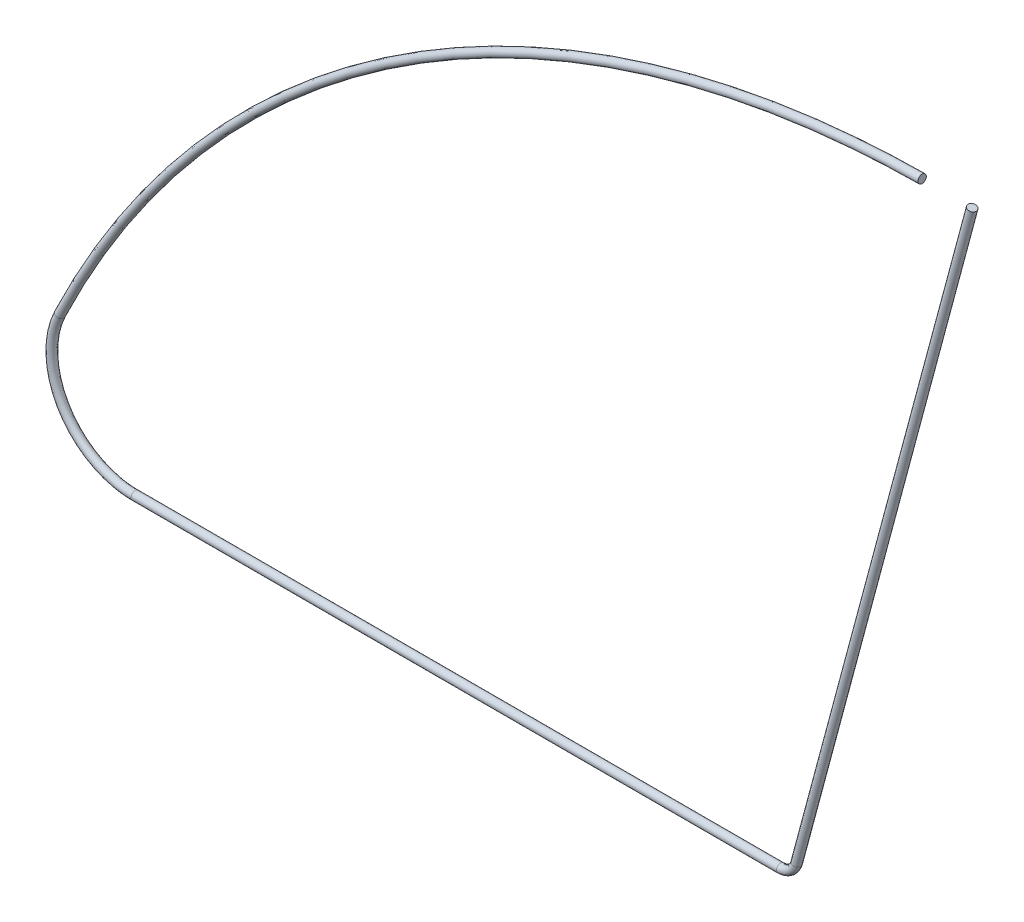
ISO-10303-21;
HEADER;
FILE_DESCRIPTION(('STEP AP214'),'2;1');
FILE_NAME('part.step','',(''),(''),'','','');
FILE_SCHEMA(('AUTOMOTIVE_DESIGN { 1 0 10303 214 1 1 1 1 }'));
ENDSEC;
DATA;
#1=APPLICATION_CONTEXT('core data for automotive mechanical design processes');
#2=APPLICATION_PROTOCOL_DEFINITION('international standard','automotive_design',2000,#1);
#3=PRODUCT_CONTEXT('',#1,'mechanical');
#4=PRODUCT('Part','Part','',(#3));
#5=PRODUCT_RELATED_PRODUCT_CATEGORY('part','',(#4));
#6=PRODUCT_DEFINITION_FORMATION('','',#4);
#7=PRODUCT_DEFINITION_CONTEXT('part definition',#1,'design');
#8=PRODUCT_DEFINITION('design','',#6,#7);
#9=PRODUCT_DEFINITION_SHAPE('','',#8);
#10=(LENGTH_UNIT() NAMED_UNIT(*) SI_UNIT(.MILLI.,.METRE.));
#11=(NAMED_UNIT(*) PLANE_ANGLE_UNIT() SI_UNIT($,.RADIAN.));
#12=(NAMED_UNIT(*) SI_UNIT($,.STERADIAN.) SOLID_ANGLE_UNIT());
#13=UNCERTAINTY_MEASURE_WITH_UNIT(LENGTH_MEASURE(1.E-05),#10,'distance_accuracy_value','');
#14=(GEOMETRIC_REPRESENTATION_CONTEXT(3) GLOBAL_UNCERTAINTY_ASSIGNED_CONTEXT((#13)) GLOBAL_UNIT_ASSIGNED_CONTEXT((#10,
#11,#12)) REPRESENTATION_CONTEXT('',''));
#15=CARTESIAN_POINT('',(0.,0.,0.));
#16=DIRECTION('',(0.,0.,1.));
#17=DIRECTION('',(1.,0.,0.));
#18=AXIS2_PLACEMENT_3D('',#15,#16,#17);
#19=CARTESIAN_POINT('',(-15.0376797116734,-78.5136895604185,0.));
#20=DIRECTION('',(-0.26679285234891,-0.963753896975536,0.));
#21=DIRECTION('',(0.,0.,-1.));
#22=AXIS2_PLACEMENT_3D('',#19,#20,#21);
#23=CIRCLE('',#22,0.499999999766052);
#24=DIRECTION('',(0.258819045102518,0.965925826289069,0.));
#25=VECTOR('',#24,1.);
#26=SURFACE_OF_LINEAR_EXTRUSION('',#23,#25);
#27=CARTESIAN_POINT('',(-15.0376797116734,-78.5136895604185,-0.499999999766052));
#28=VERTEX_POINT('',#27);
#29=EDGE_CURVE('E30',#28,#28,#23,.T.);
#30=ORIENTED_EDGE('',*,*,#29,.F.);
#31=EDGE_LOOP('',(#30));
#32=FACE_BOUND('',#31,.T.);
#33=CARTESIAN_POINT('',(6.00000000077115,-2.1348200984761E-10,0.));
#34=DIRECTION('',(-0.26679285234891,-0.963753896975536,0.));
#35=DIRECTION('',(0.,0.,-1.));
#36=AXIS2_PLACEMENT_3D('',#33,#34,#35);
#37=CIRCLE('',#36,0.499999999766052);
#38=CARTESIAN_POINT('',(6.00000000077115,-2.1348200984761E-10,-0.499999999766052));
#39=VERTEX_POINT('',#38);
#40=EDGE_CURVE('E10',#39,#39,#37,.T.);
#41=ORIENTED_EDGE('',*,*,#40,.T.);
#42=EDGE_LOOP('',(#41));
#43=FACE_BOUND('',#42,.T.);
#44=ADVANCED_FACE('F24',(#32,#43),#26,.F.);
#45=CARTESIAN_POINT('',(-16.9695313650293,-79.9960514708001,0.));
#46=DIRECTION('',(-0.999965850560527,0.00826424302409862,0.));
#47=DIRECTION('',(0.,0.,-1.));
#48=AXIS2_PLACEMENT_3D('',#45,#46,#47);
#49=CIRCLE('',#48,0.499999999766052);
#50=CARTESIAN_POINT('',(-16.9695313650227,-77.99605147,0.));
#51=DIRECTION('',(0.,0.,1.));
#52=AXIS1_PLACEMENT('',#50,#51);
#53=SURFACE_OF_REVOLUTION('',#49,#52);
#54=CARTESIAN_POINT('',(-16.9695313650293,-79.9960514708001,-0.499999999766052));
#55=VERTEX_POINT('',#54);
#56=EDGE_CURVE('E34',#55,#55,#49,.T.);
#57=ORIENTED_EDGE('',*,*,#56,.F.);
#58=EDGE_LOOP('',(#57));
#59=FACE_BOUND('',#58,.T.);
#60=ORIENTED_EDGE('',*,*,#29,.T.);
#61=EDGE_LOOP('',(#60));
#62=FACE_BOUND('',#61,.T.);
#63=ADVANCED_FACE('F45',(#59,#62),#53,.T.);
#64=CARTESIAN_POINT('',(-94.3072413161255,-79.9960514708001,0.));
#65=DIRECTION('',(-0.999965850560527,0.00826424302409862,0.));
#66=DIRECTION('',(0.,0.,-1.));
#67=AXIS2_PLACEMENT_3D('',#64,#65,#66);
#68=CIRCLE('',#67,0.499999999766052);
#69=DIRECTION('',(1.,0.,0.));
#70=VECTOR('',#69,1.);
#71=SURFACE_OF_LINEAR_EXTRUSION('',#68,#70);
#72=CARTESIAN_POINT('',(-94.3072413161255,-79.9960514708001,-0.499999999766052));
#73=VERTEX_POINT('',#72);
#74=EDGE_CURVE('E38',#73,#73,#68,.T.);
#75=ORIENTED_EDGE('',*,*,#74,.F.);
#76=EDGE_LOOP('',(#75));
#77=FACE_BOUND('',#76,.T.);
#78=ORIENTED_EDGE('',*,*,#56,.T.);
#79=EDGE_LOOP('',(#78));
#80=FACE_BOUND('',#79,.T.);
#81=ADVANCED_FACE('F48',(#77,#80),#71,.F.);
#82=CARTESIAN_POINT('',(-103.326204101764,-65.676524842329,0.));
#83=DIRECTION('',(0.439391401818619,0.898295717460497,0.));
#84=DIRECTION('',(0.,0.,-1.));
#85=AXIS2_PLACEMENT_3D('',#82,#83,#84);
#86=CIRCLE('',#85,0.499999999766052);
#87=CARTESIAN_POINT('',(-94.3072413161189,-69.99605147,0.));
#88=DIRECTION('',(0.,0.,1.));
#89=AXIS1_PLACEMENT('',#87,#88);
#90=SURFACE_OF_REVOLUTION('',#86,#89);
#91=CARTESIAN_POINT('',(-103.326204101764,-65.676524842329,-0.499999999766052));
#92=VERTEX_POINT('',#91);
#93=EDGE_CURVE('E60',#92,#92,#86,.T.);
#94=ORIENTED_EDGE('',*,*,#93,.F.);
#95=EDGE_LOOP('',(#94));
#96=FACE_BOUND('',#95,.T.);
#97=ORIENTED_EDGE('',*,*,#74,.T.);
#98=EDGE_LOOP('',(#97));
#99=FACE_BOUND('',#98,.T.);
#100=ADVANCED_FACE('F52',(#96,#99),#90,.T.);
#101=CARTESIAN_POINT('',(0.955553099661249,-115.621051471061,0.));
#102=DIRECTION('',(0.,0.,-1.));
#103=AXIS1_PLACEMENT('',#101,#102);
#104=SURFACE_OF_REVOLUTION('',#86,#103);
#105=ORIENTED_EDGE('',*,*,#93,.T.);
#106=EDGE_LOOP('',(#105));
#107=FACE_BOUND('',#106,.T.);
#108=CARTESIAN_POINT('',(0.,8.0017242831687E-10,0.));
#109=DIRECTION('',(1.,0.,0.));
#110=DIRECTION('',(0.,0.,-1.));
#111=AXIS2_PLACEMENT_3D('',#108,#109,#110);
#112=CIRCLE('',#111,0.499999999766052);
#113=CARTESIAN_POINT('',(0.,8.0017242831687E-10,-0.499999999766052));
#114=VERTEX_POINT('',#113);
#115=EDGE_CURVE('E64',#114,#114,#112,.T.);
#116=ORIENTED_EDGE('',*,*,#115,.F.);
#117=EDGE_LOOP('',(#116));
#118=FACE_BOUND('',#117,.T.);
#119=ADVANCED_FACE('F56',(#107,#118),#104,.F.);
#120=CARTESIAN_POINT('',(6.00000000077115,-2.1348200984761E-10,0.));
#121=DIRECTION('',(-0.26679285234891,-0.963753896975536,0.));
#122=DIRECTION('',(0.,0.,-1.));
#123=AXIS2_PLACEMENT_3D('',#120,#121,#122);
#124=PLANE('',#123);
#125=ORIENTED_EDGE('',*,*,#40,.F.);
#126=EDGE_LOOP('',(#125));
#127=FACE_BOUND('',#126,.T.);
#128=ADVANCED_FACE('F58',(#127),#124,.F.);
#129=CARTESIAN_POINT('',(0.,8.0017242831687E-10,0.));
#130=DIRECTION('',(1.,0.,0.));
#131=DIRECTION('',(0.,0.,-1.));
#132=AXIS2_PLACEMENT_3D('',#129,#130,#131);
#133=PLANE('',#132);
#134=ORIENTED_EDGE('',*,*,#115,.T.);
#135=EDGE_LOOP('',(#134));
#136=FACE_BOUND('',#135,.T.);
#137=ADVANCED_FACE('F69',(#136),#133,.T.);
#138=CLOSED_SHELL('',(#44,#63,#81,#100,#119,#128,#137));
#139=MANIFOLD_SOLID_BREP('B2',#138);
#140=ADVANCED_BREP_SHAPE_REPRESENTATION('',(#18,#139),#14);
#141=SHAPE_DEFINITION_REPRESENTATION(#9,#140);
ENDSEC;
END-ISO-10303-21;
